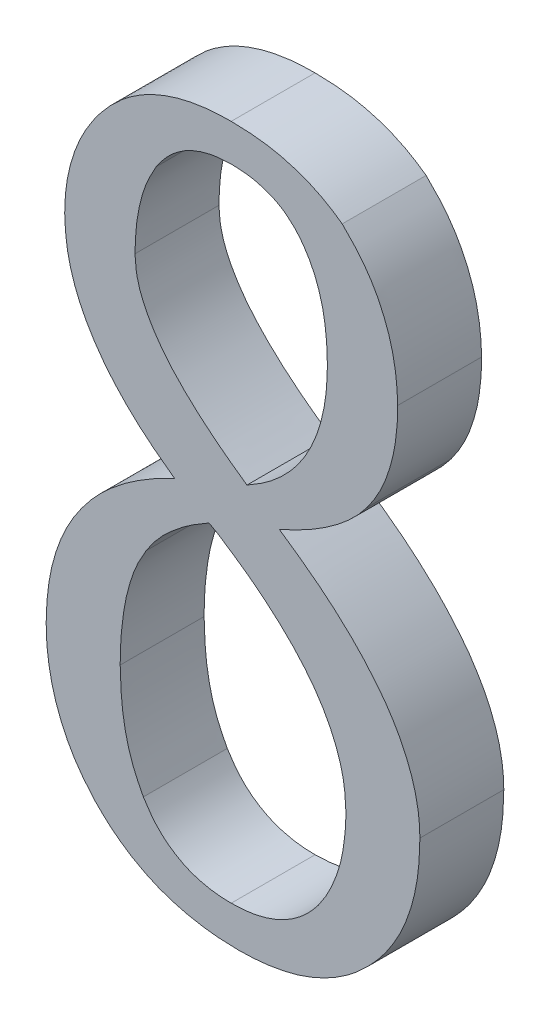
from build123d import *

# Parameters (mm, degrees)
EXTRUDE_1_DEPTH = 3


with BuildPart() as part:
    # Sketch 1 → Extrude 1 (new body)
    with BuildSketch(Plane.XY):
        with BuildLine():
            add(Edge.make_bspline(
                [(8.333333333, 23.941798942), (8.527780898, 23.937737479), (8.909265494, 23.929769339), (9.469442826, 23.875985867), (10.005301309, 23.783671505), (10.514407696, 23.651043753), (11.000058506, 23.483908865), (11.458642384, 23.278364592), (11.896155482, 23.037675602), (12.166091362, 22.847022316), (12.301587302, 22.751322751)],
                knots=[0, 0, 0, 0, 1.106816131, 2.171450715, 3.199963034, 4.198767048, 5.163016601, 6.120070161, 7.0563579, 8, 8, 8, 8], degree=3))
            add(Edge.make_bspline(
                [(12.301587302, 22.751322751), (12.456428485, 22.597316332), (12.762883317, 22.292513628), (13.166868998, 21.790747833), (13.506922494, 21.254783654), (13.780349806, 20.68572078), (14.005767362, 20.090586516), (14.158870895, 19.460181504), (14.260148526, 18.800953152), (14.277095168, 18.350695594), (14.285714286, 18.121693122)],
                knots=[0, 0, 0, 0, 1.01047365, 1.999884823, 2.975157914, 3.942162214, 4.918138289, 5.915603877, 6.939869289, 8, 8, 8, 8], degree=3))
            add(Edge.make_bspline(
                [(14.285714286, 18.121693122), (14.284005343, 17.938611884), (14.280655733, 17.579763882), (14.221648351, 17.055032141), (14.143467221, 16.552509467), (14.017485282, 16.077261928), (13.86733364, 15.623998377), (13.681083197, 15.19480057), (13.455249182, 14.792636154), (13.280217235, 14.542377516), (13.193219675, 14.417989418)],
                knots=[0, 0, 0, 0, 1.117419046, 2.190194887, 3.221511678, 4.220543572, 5.188783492, 6.135624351, 7.073334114, 8, 8, 8, 8], degree=3))
            add(Edge.make_bspline(
                [(13.193219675, 14.417989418), (13.108555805, 14.310215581), (12.936795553, 14.091571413), (12.636162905, 13.785544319), (12.301003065, 13.488614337), (11.923499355, 13.204287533), (11.514147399, 12.923436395), (11.06114568, 12.662232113), (10.574206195, 12.403488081), (10.230245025, 12.248974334), (10.052910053, 12.169312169)],
                knots=[0, 0, 0, 0, 0.841975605, 1.708142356, 2.632728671, 3.592508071, 4.611621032, 5.682571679, 6.805210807, 8, 8, 8, 8], degree=3))
            add(Edge.make_bspline(
                [(10.052910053, 12.169312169), (10.256462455, 12.030346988), (10.654797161, 11.758403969), (11.222558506, 11.333689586), (11.76071919, 10.917354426), (12.246013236, 10.482949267), (12.703251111, 10.057844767), (13.112645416, 9.621639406), (13.485041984, 9.183695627), (13.828787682, 8.749780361), (14.117967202, 8.303100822), (14.378994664, 7.859606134), (14.592515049, 7.409463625), (14.770253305, 6.957931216), (14.909114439, 6.504393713), (15.006910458, 6.047160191), (15.067913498, 5.586603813), (15.07555703, 5.278123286), (15.079365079, 5.124436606)],
                knots=[0, 0, 0, 0, 1.312307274, 2.568073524, 3.775483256, 4.933889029, 6.035028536, 7.099287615, 8.117053, 9.096382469, 10.044280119, 10.948194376, 11.835047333, 12.694179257, 13.530473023, 14.357720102, 15.181807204, 16, 16, 16, 16], degree=3))
            add(Edge.make_bspline(
                [(15.079365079, 5.124436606), (15.073578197, 4.879245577), (15.062278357, 4.4004697), (14.978158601, 3.700157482), (14.837089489, 3.035424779), (14.635454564, 2.407448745), (14.380561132, 1.813385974), (14.063322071, 1.259208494), (13.698618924, 0.733395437), (13.407855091, 0.421308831), (13.26180678, 0.264550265)],
                knots=[0, 0, 0, 0, 1.104672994, 2.157056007, 3.173129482, 4.162170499, 5.124545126, 6.080172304, 7.035686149, 8, 8, 8, 8], degree=3))
            add(Edge.make_bspline(
                [(13.26180678, 0.264550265), (13.109914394, 0.115520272), (12.81053627, -0.178216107), (12.306551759, -0.552954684), (11.773298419, -0.872061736), (11.20296072, -1.133422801), (10.601419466, -1.340831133), (9.961574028, -1.479942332), (9.291307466, -1.571505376), (8.831719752, -1.581974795), (8.597883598, -1.587301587)],
                knots=[0, 0, 0, 0, 0.988427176, 1.948178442, 2.911796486, 3.873258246, 4.860138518, 5.864075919, 6.913251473, 8, 8, 8, 8], degree=3))
            add(Edge.make_bspline(
                [(8.597883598, -1.587301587), (8.336272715, -1.580749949), (7.825848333, -1.567967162), (7.079595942, -1.467069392), (6.372343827, -1.306483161), (5.701848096, -1.083232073), (5.074862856, -0.784041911), (4.485421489, -0.427154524), (3.933576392, -0.002288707), (3.605444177, 0.327617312), (3.439153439, 0.494806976)],
                knots=[0, 0, 0, 0, 1.095636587, 2.137677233, 3.148345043, 4.130525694, 5.091438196, 6.052350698, 7.012970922, 8, 8, 8, 8], degree=3))
            add(Edge.make_bspline(
                [(3.439153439, 0.494806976), (3.302430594, 0.654225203), (3.031174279, 0.970508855), (2.676218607, 1.481827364), (2.380708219, 2.024632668), (2.142536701, 2.595503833), (1.947226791, 3.188974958), (1.819244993, 3.812158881), (1.730290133, 4.458853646), (1.72318294, 4.900396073), (1.71957672, 5.124436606)],
                knots=[0, 0, 0, 0, 0.996087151, 1.976223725, 2.947128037, 3.922874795, 4.907960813, 5.906456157, 6.937726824, 8, 8, 8, 8], degree=3))
            add(Edge.make_bspline(
                [(1.71957672, 5.124436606), (1.723536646, 5.31400754), (1.731336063, 5.687383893), (1.787142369, 6.23717802), (1.872751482, 6.768454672), (2.002840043, 7.280126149), (2.162564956, 7.773699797), (2.359118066, 8.248097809), (2.595965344, 8.699017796), (2.865882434, 9.131608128), (3.17092481, 9.544043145), (3.510224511, 9.938343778), (3.888929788, 10.311656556), (4.306100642, 10.661512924), (4.753751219, 10.998538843), (5.240022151, 11.30971989), (5.760472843, 11.606820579), (6.127538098, 11.781367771), (6.314912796, 11.870468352)],
                knots=[0, 0, 0, 0, 1.047417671, 2.062979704, 3.051025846, 4.018416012, 4.97726636, 5.915772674, 6.852194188, 7.788659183, 8.730802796, 9.684159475, 10.660473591, 11.665719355, 12.69085861, 13.754669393, 14.853832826, 16, 16, 16, 16], degree=3))
            add(Edge.make_bspline(
                [(6.314912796, 11.870468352), (6.003713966, 12.098715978), (5.40333232, 12.539063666), (4.600331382, 13.263233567), (3.915158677, 14.009207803), (3.360129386, 14.785500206), (2.918545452, 15.582197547), (2.606977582, 16.406560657), (2.419999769, 17.257639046), (2.393981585, 17.833378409), (2.380952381, 18.121693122)],
                knots=[0, 0, 0, 0, 1.203876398, 2.322583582, 3.368942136, 4.358982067, 5.294132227, 6.203838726, 7.100530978, 8, 8, 8, 8], degree=3))
            add(Edge.make_bspline(
                [(2.380952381, 18.121693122), (2.384958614, 18.317962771), (2.392837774, 18.703971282), (2.47630314, 19.272585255), (2.600871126, 19.821050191), (2.780999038, 20.349806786), (3.003232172, 20.86132799), (3.289241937, 21.347659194), (3.613241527, 21.822225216), (3.871765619, 22.110621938), (4.002547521, 22.256515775)],
                knots=[0, 0, 0, 0, 1.034308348, 2.034200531, 3.024366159, 3.996580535, 4.975901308, 5.959679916, 6.967844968, 8, 8, 8, 8], degree=3))
            add(Edge.make_bspline(
                [(4.002547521, 22.256515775), (4.138343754, 22.392165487), (4.407841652, 22.661372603), (4.863803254, 23.004133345), (5.352151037, 23.29740746), (5.880142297, 23.530445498), (6.441956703, 23.71949582), (7.041642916, 23.849236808), (7.676279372, 23.929724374), (8.1109915, 23.937713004), (8.333333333, 23.941798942)],
                knots=[0, 0, 0, 0, 0.961682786, 1.908532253, 2.852472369, 3.81300346, 4.797232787, 5.820657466, 6.885333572, 8, 8, 8, 8], degree=3))
        make_face()
        with BuildLine():
            add(Edge.make_bspline(
                [(7.53968254, 11.111111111), (7.293942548, 10.96848673), (6.823540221, 10.695471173), (6.209349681, 10.206892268), (5.682704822, 9.701422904), (5.419029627, 9.314735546), (5.291005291, 9.126984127)],
                knots=[0, 0, 0, 0, 1.123679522, 2.15097859, 3.102229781, 4, 4, 4, 4], degree=3))
            add(Edge.make_bspline(
                [(5.291005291, 9.126984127), (5.217252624, 9.000660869), (5.067229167, 8.743701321), (4.873173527, 8.329286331), (4.721141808, 7.875674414), (4.586040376, 7.39261301), (4.491363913, 6.872328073), (4.417521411, 6.321549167), (4.372864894, 5.73428367), (4.367728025, 5.331908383), (4.365079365, 5.124436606)],
                knots=[0, 0, 0, 0, 0.843418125, 1.715632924, 2.632999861, 3.599428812, 4.606091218, 5.679653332, 6.803588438, 8, 8, 8, 8], degree=3))
            add(Edge.make_bspline(
                [(4.365079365, 5.124436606), (4.375286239, 4.766183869), (4.394821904, 4.080498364), (4.545487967, 3.104306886), (4.797489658, 2.225218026), (5.063956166, 1.706349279), (5.193023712, 1.455026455)],
                knots=[0, 0, 0, 0, 1.130060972, 2.162904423, 3.110171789, 4, 4, 4, 4], degree=3))
            add(Edge.make_bspline(
                [(5.193023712, 1.455026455), (5.281598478, 1.319088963), (5.454928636, 1.05307565), (5.759192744, 0.695222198), (6.106482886, 0.398611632), (6.487728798, 0.158973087), (6.898123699, -0.038998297), (7.347809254, -0.164839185), (7.828397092, -0.254960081), (8.161400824, -0.261284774), (8.333333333, -0.264550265)],
                knots=[0, 0, 0, 0, 1.034346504, 2.024091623, 2.984458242, 3.93517269, 4.890441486, 5.879199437, 6.905013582, 8, 8, 8, 8], degree=3))
            add(Edge.make_bspline(
                [(8.333333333, -0.264550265), (8.495223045, -0.259613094), (8.810708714, -0.24999169), (9.269907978, -0.181916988), (9.699752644, -0.062233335), (10.105703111, 0.098935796), (10.483698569, 0.310921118), (10.835559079, 0.569168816), (11.160943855, 0.87265669), (11.348992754, 1.106378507), (11.444248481, 1.224769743)],
                knots=[0, 0, 0, 0, 1.084050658, 2.11256444, 3.09954078, 4.066192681, 5.03067699, 5.993113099, 6.983416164, 8, 8, 8, 8], degree=3))
            add(Edge.make_bspline(
                [(11.444248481, 1.224769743), (11.523227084, 1.339319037), (11.682303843, 1.570041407), (11.882188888, 1.945196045), (12.051803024, 2.340895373), (12.196939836, 2.755632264), (12.304779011, 3.193650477), (12.373766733, 3.654770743), (12.427622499, 4.135212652), (12.431758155, 4.462898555), (12.433862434, 4.62962963)],
                knots=[0, 0, 0, 0, 0.925478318, 1.864075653, 2.823154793, 3.789046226, 4.785520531, 5.820151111, 6.890863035, 8, 8, 8, 8], degree=3))
            add(Edge.make_bspline(
                [(12.433862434, 4.62962963), (12.419320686, 4.911879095), (12.390070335, 5.479616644), (12.161640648, 6.318516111), (11.798511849, 7.13958043), (11.291716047, 7.944431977), (10.633151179, 8.726493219), (9.835742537, 9.492443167), (8.898558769, 10.247612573), (8.202030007, 10.705552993), (7.838526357, 10.944542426)],
                knots=[0, 0, 0, 0, 0.83037385, 1.670275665, 2.542441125, 3.46722938, 4.461121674, 5.546119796, 6.71937175, 8, 8, 8, 8], degree=3))
            Line((7.838526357, 10.944542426), (7.53968254, 11.111111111))
        make_face(mode=Mode.SUBTRACT)
        with BuildLine():
            add(Edge.make_bspline(
                [(8.896727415, 12.962962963), (9.126452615, 13.096967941), (9.574873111, 13.358543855), (10.162716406, 13.852921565), (10.664882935, 14.404077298), (11.070068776, 15.025555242), (11.386077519, 15.708919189), (11.610332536, 16.457563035), (11.750348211, 17.268915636), (11.764967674, 17.832057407), (11.772486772, 18.121693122)],
                knots=[0, 0, 0, 0, 1.02245018, 1.995808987, 2.944127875, 3.884155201, 4.840673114, 5.833238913, 6.885588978, 8, 8, 8, 8], degree=3))
            add(Edge.make_bspline(
                [(11.772486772, 18.121693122), (11.768645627, 18.316170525), (11.761173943, 18.694462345), (11.705670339, 19.244316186), (11.622069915, 19.758403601), (11.491773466, 20.232938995), (11.332115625, 20.672812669), (11.130166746, 21.074408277), (10.896701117, 21.442086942), (10.708946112, 21.656107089), (10.616304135, 21.761708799)],
                knots=[0, 0, 0, 0, 1.193187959, 2.320954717, 3.388522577, 4.385209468, 5.336425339, 6.255150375, 7.139057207, 8, 8, 8, 8], degree=3))
            add(Edge.make_bspline(
                [(10.616304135, 21.761708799), (10.471939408, 21.89580667), (10.181197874, 22.165871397), (9.626623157, 22.423711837), (9.006573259, 22.59354981), (8.564903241, 22.610277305), (8.333333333, 22.619047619)],
                knots=[0, 0, 0, 0, 0.93844848, 1.889976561, 2.893703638, 4, 4, 4, 4], degree=3))
            add(Edge.make_bspline(
                [(8.333333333, 22.619047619), (8.191062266, 22.613733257), (7.91485782, 22.603415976), (7.510752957, 22.540652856), (7.13531764, 22.426101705), (6.780980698, 22.276534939), (6.459967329, 22.06900936), (6.159699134, 21.825253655), (5.88719483, 21.532434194), (5.732591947, 21.311359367), (5.653537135, 21.198314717)],
                knots=[0, 0, 0, 0, 1.076175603, 2.089282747, 3.081705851, 4.038450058, 4.987512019, 5.961554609, 6.957659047, 8, 8, 8, 8], degree=3))
            add(Edge.make_bspline(
                [(5.653537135, 21.198314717), (5.534744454, 20.984550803), (5.291460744, 20.546768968), (5.065803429, 19.80247902), (4.919861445, 18.988129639), (4.902962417, 18.417995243), (4.894179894, 18.121693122)],
                knots=[0, 0, 0, 0, 0.912604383, 1.868985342, 2.892499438, 4, 4, 4, 4], degree=3))
            add(Edge.make_bspline(
                [(4.894179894, 18.121693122), (4.907629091, 17.917953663), (4.935377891, 17.497592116), (5.133196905, 16.868105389), (5.456924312, 16.235607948), (5.89677892, 15.590911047), (6.470623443, 14.943658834), (7.164357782, 14.284570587), (7.980177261, 13.612340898), (8.581884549, 13.186029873), (8.896727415, 12.962962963)],
                knots=[0, 0, 0, 0, 0.722540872, 1.490768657, 2.320107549, 3.237907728, 4.252461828, 5.383725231, 6.631036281, 8, 8, 8, 8], degree=3))
        make_face(mode=Mode.SUBTRACT)
    extrude(amount=EXTRUDE_1_DEPTH)


solid = part.part
